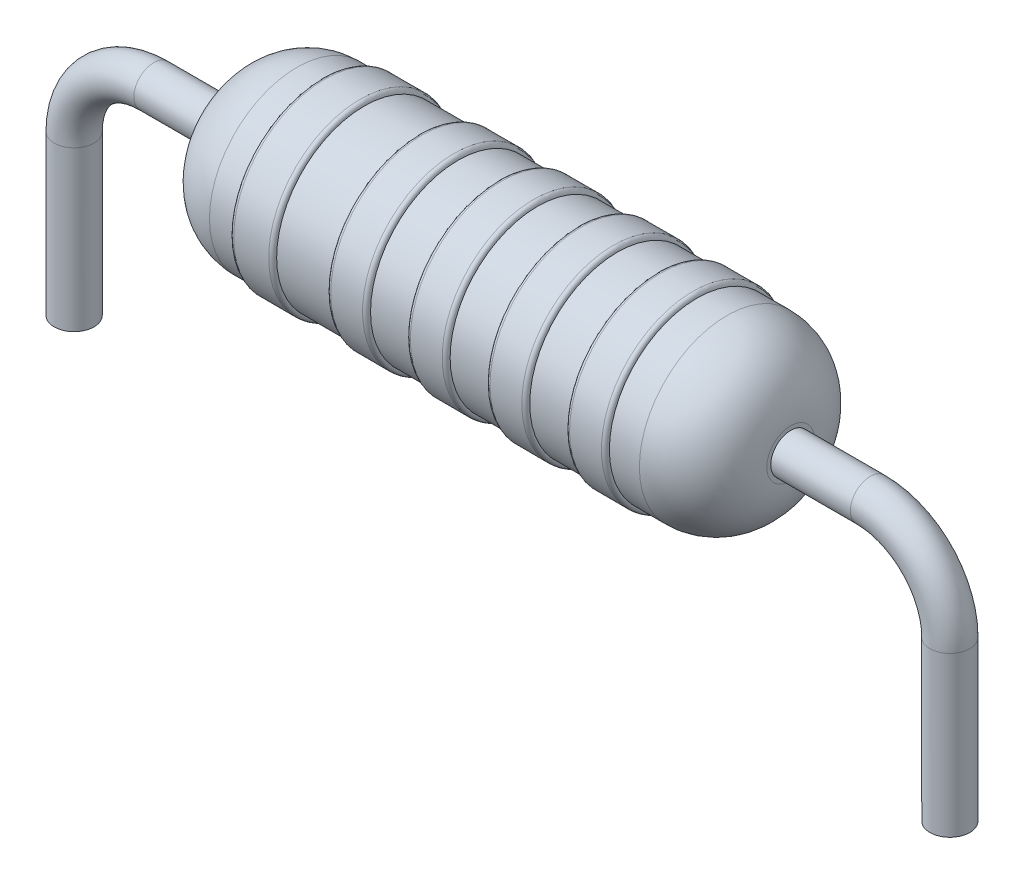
ISO-10303-21;
HEADER;
FILE_DESCRIPTION(('STEP AP214'),'2;1');
FILE_NAME('part.step','',(''),(''),'','','');
FILE_SCHEMA(('AUTOMOTIVE_DESIGN { 1 0 10303 214 1 1 1 1 }'));
ENDSEC;
DATA;
#1=APPLICATION_CONTEXT('core data for automotive mechanical design processes');
#2=APPLICATION_PROTOCOL_DEFINITION('international standard','automotive_design',2000,#1);
#3=PRODUCT_CONTEXT('',#1,'mechanical');
#4=PRODUCT('Part','Part','',(#3));
#5=PRODUCT_RELATED_PRODUCT_CATEGORY('part','',(#4));
#6=PRODUCT_DEFINITION_FORMATION('','',#4);
#7=PRODUCT_DEFINITION_CONTEXT('part definition',#1,'design');
#8=PRODUCT_DEFINITION('design','',#6,#7);
#9=PRODUCT_DEFINITION_SHAPE('','',#8);
#10=(LENGTH_UNIT() NAMED_UNIT(*) SI_UNIT(.MILLI.,.METRE.));
#11=(NAMED_UNIT(*) PLANE_ANGLE_UNIT() SI_UNIT($,.RADIAN.));
#12=(NAMED_UNIT(*) SI_UNIT($,.STERADIAN.) SOLID_ANGLE_UNIT());
#13=UNCERTAINTY_MEASURE_WITH_UNIT(LENGTH_MEASURE(1.E-05),#10,'distance_accuracy_value','');
#14=(GEOMETRIC_REPRESENTATION_CONTEXT(3) GLOBAL_UNCERTAINTY_ASSIGNED_CONTEXT((#13)) GLOBAL_UNIT_ASSIGNED_CONTEXT((#10,
#11,#12)) REPRESENTATION_CONTEXT('',''));
#15=CARTESIAN_POINT('',(0.,0.,0.));
#16=DIRECTION('',(0.,0.,1.));
#17=DIRECTION('',(1.,0.,0.));
#18=AXIS2_PLACEMENT_3D('',#15,#16,#17);
#19=CARTESIAN_POINT('',(-3.5,0.,0.));
#20=DIRECTION('',(1.,0.,0.));
#21=DIRECTION('',(0.,0.,-1.));
#22=AXIS2_PLACEMENT_3D('',#19,#20,#21);
#23=PLANE('',#22);
#24=CARTESIAN_POINT('',(-3.5,0.,0.));
#25=DIRECTION('',(-1.,0.,0.));
#26=DIRECTION('',(0.,0.,1.));
#27=AXIS2_PLACEMENT_3D('',#24,#25,#26);
#28=CIRCLE('',#27,0.299999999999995);
#29=CARTESIAN_POINT('',(-3.5,0.,0.299999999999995));
#30=VERTEX_POINT('',#29);
#31=EDGE_CURVE('E108',#30,#30,#28,.T.);
#32=ORIENTED_EDGE('',*,*,#31,.T.);
#33=EDGE_LOOP('',(#32));
#34=FACE_BOUND('',#33,.T.);
#35=CARTESIAN_POINT('',(-3.5,0.,0.));
#36=DIRECTION('',(1.,0.,0.));
#37=DIRECTION('',(0.,0.,-1.));
#38=AXIS2_PLACEMENT_3D('',#35,#36,#37);
#39=CIRCLE('',#38,0.25);
#40=CARTESIAN_POINT('',(-3.5,0.,-0.25));
#41=VERTEX_POINT('',#40);
#42=EDGE_CURVE('E75',#41,#41,#39,.F.);
#43=ORIENTED_EDGE('',*,*,#42,.F.);
#44=EDGE_LOOP('',(#43));
#45=FACE_BOUND('',#44,.T.);
#46=ADVANCED_FACE('F37',(#34,#45),#23,.F.);
#47=CARTESIAN_POINT('',(-54.2686615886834,0.,0.));
#48=DIRECTION('',(-1.,0.,0.));
#49=DIRECTION('',(0.,0.,1.));
#50=AXIS2_PLACEMENT_3D('',#47,#48,#49);
#51=CYLINDRICAL_SURFACE('',#50,1.1);
#52=CARTESIAN_POINT('',(-1.85616518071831,0.,0.));
#53=DIRECTION('',(1.,0.,0.));
#54=DIRECTION('',(0.,0.,-1.));
#55=AXIS2_PLACEMENT_3D('',#52,#53,#54);
#56=CIRCLE('',#55,1.1);
#57=CARTESIAN_POINT('',(-1.85616518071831,0.,-1.1));
#58=VERTEX_POINT('',#57);
#59=EDGE_CURVE('E87',#58,#58,#56,.T.);
#60=ORIENTED_EDGE('',*,*,#59,.T.);
#61=EDGE_LOOP('',(#60));
#62=FACE_BOUND('',#61,.T.);
#63=CARTESIAN_POINT('',(-1.17702485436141,0.,0.));
#64=DIRECTION('',(-1.,0.,0.));
#65=DIRECTION('',(0.,0.,1.));
#66=AXIS2_PLACEMENT_3D('',#63,#64,#65);
#67=CIRCLE('',#66,1.1);
#68=CARTESIAN_POINT('',(-1.17702485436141,0.,1.1));
#69=VERTEX_POINT('',#68);
#70=EDGE_CURVE('E102',#69,#69,#67,.T.);
#71=ORIENTED_EDGE('',*,*,#70,.T.);
#72=EDGE_LOOP('',(#71));
#73=FACE_BOUND('',#72,.T.);
#74=ADVANCED_FACE('F171',(#62,#73),#51,.T.);
#75=CARTESIAN_POINT('',(-0.177024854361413,0.,0.));
#76=DIRECTION('',(-1.,0.,0.));
#77=DIRECTION('',(0.,0.,1.));
#78=AXIS2_PLACEMENT_3D('',#75,#76,#77);
#79=CIRCLE('',#78,1.1);
#80=CARTESIAN_POINT('',(-0.177024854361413,0.,1.1));
#81=VERTEX_POINT('',#80);
#82=EDGE_CURVE('E96',#81,#81,#79,.T.);
#83=ORIENTED_EDGE('',*,*,#82,.T.);
#84=EDGE_LOOP('',(#83));
#85=FACE_BOUND('',#84,.T.);
#86=CARTESIAN_POINT('',(-0.677024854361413,0.,0.));
#87=DIRECTION('',(1.,0.,0.));
#88=DIRECTION('',(0.,0.,-1.));
#89=AXIS2_PLACEMENT_3D('',#86,#87,#88);
#90=CIRCLE('',#89,1.1);
#91=CARTESIAN_POINT('',(-0.677024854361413,0.,-1.1));
#92=VERTEX_POINT('',#91);
#93=EDGE_CURVE('E105',#92,#92,#90,.T.);
#94=ORIENTED_EDGE('',*,*,#93,.T.);
#95=EDGE_LOOP('',(#94));
#96=FACE_BOUND('',#95,.T.);
#97=ADVANCED_FACE('F177',(#85,#96),#51,.T.);
#98=CARTESIAN_POINT('',(4.3261723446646,0.,0.));
#99=DIRECTION('',(1.,0.,0.));
#100=DIRECTION('',(0.,0.,-1.));
#101=AXIS2_PLACEMENT_3D('',#98,#99,#100);
#102=CYLINDRICAL_SURFACE('',#101,1.15);
#103=CARTESIAN_POINT('',(-1.12702485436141,0.,0.));
#104=DIRECTION('',(-1.,0.,0.));
#105=DIRECTION('',(0.,0.,1.));
#106=AXIS2_PLACEMENT_3D('',#103,#104,#105);
#107=CIRCLE('',#106,1.15);
#108=CARTESIAN_POINT('',(-1.12702485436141,0.,1.15));
#109=VERTEX_POINT('',#108);
#110=EDGE_CURVE('E63',#109,#109,#107,.F.);
#111=ORIENTED_EDGE('',*,*,#110,.T.);
#112=EDGE_LOOP('',(#111));
#113=FACE_BOUND('',#112,.T.);
#114=CARTESIAN_POINT('',(-0.727024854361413,0.,0.));
#115=DIRECTION('',(1.,0.,0.));
#116=DIRECTION('',(0.,0.,-1.));
#117=AXIS2_PLACEMENT_3D('',#114,#115,#116);
#118=CIRCLE('',#117,1.15);
#119=CARTESIAN_POINT('',(-0.727024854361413,0.,-1.15));
#120=VERTEX_POINT('',#119);
#121=EDGE_CURVE('E66',#120,#120,#118,.F.);
#122=ORIENTED_EDGE('',*,*,#121,.T.);
#123=EDGE_LOOP('',(#122));
#124=FACE_BOUND('',#123,.T.);
#125=ADVANCED_FACE('F185',(#113,#124),#102,.T.);
#126=CARTESIAN_POINT('',(4.3261723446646,0.,0.));
#127=DIRECTION('',(1.,0.,0.));
#128=DIRECTION('',(0.,0.,-1.));
#129=AXIS2_PLACEMENT_3D('',#126,#127,#128);
#130=CYLINDRICAL_SURFACE('',#129,1.15);
#131=CARTESIAN_POINT('',(-0.127024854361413,0.,0.));
#132=DIRECTION('',(-1.,0.,0.));
#133=DIRECTION('',(0.,0.,1.));
#134=AXIS2_PLACEMENT_3D('',#131,#132,#133);
#135=CIRCLE('',#134,1.15);
#136=CARTESIAN_POINT('',(-0.127024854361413,0.,1.15));
#137=VERTEX_POINT('',#136);
#138=EDGE_CURVE('E57',#137,#137,#135,.F.);
#139=ORIENTED_EDGE('',*,*,#138,.T.);
#140=EDGE_LOOP('',(#139));
#141=FACE_BOUND('',#140,.T.);
#142=CARTESIAN_POINT('',(0.272975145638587,0.,0.));
#143=DIRECTION('',(1.,0.,0.));
#144=DIRECTION('',(0.,0.,-1.));
#145=AXIS2_PLACEMENT_3D('',#142,#143,#144);
#146=CIRCLE('',#145,1.15);
#147=CARTESIAN_POINT('',(0.272975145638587,0.,-1.15));
#148=VERTEX_POINT('',#147);
#149=EDGE_CURVE('E60',#148,#148,#146,.F.);
#150=ORIENTED_EDGE('',*,*,#149,.T.);
#151=EDGE_LOOP('',(#150));
#152=FACE_BOUND('',#151,.T.);
#153=ADVANCED_FACE('F255',(#141,#152),#130,.T.);
#154=CARTESIAN_POINT('',(0.822975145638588,0.,0.));
#155=DIRECTION('',(-1.,0.,0.));
#156=DIRECTION('',(0.,0.,1.));
#157=AXIS2_PLACEMENT_3D('',#154,#155,#156);
#158=CIRCLE('',#157,1.1);
#159=CARTESIAN_POINT('',(0.822975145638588,0.,1.1));
#160=VERTEX_POINT('',#159);
#161=EDGE_CURVE('E90',#160,#160,#158,.T.);
#162=ORIENTED_EDGE('',*,*,#161,.T.);
#163=EDGE_LOOP('',(#162));
#164=FACE_BOUND('',#163,.T.);
#165=CARTESIAN_POINT('',(0.322975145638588,0.,0.));
#166=DIRECTION('',(1.,0.,0.));
#167=DIRECTION('',(0.,0.,-1.));
#168=AXIS2_PLACEMENT_3D('',#165,#166,#167);
#169=CIRCLE('',#168,1.1);
#170=CARTESIAN_POINT('',(0.322975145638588,0.,-1.1));
#171=VERTEX_POINT('',#170);
#172=EDGE_CURVE('E99',#171,#171,#169,.T.);
#173=ORIENTED_EDGE('',*,*,#172,.T.);
#174=EDGE_LOOP('',(#173));
#175=FACE_BOUND('',#174,.T.);
#176=ADVANCED_FACE('F243',(#164,#175),#51,.T.);
#177=CARTESIAN_POINT('',(4.3261723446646,0.,0.));
#178=DIRECTION('',(1.,0.,0.));
#179=DIRECTION('',(0.,0.,-1.));
#180=AXIS2_PLACEMENT_3D('',#177,#178,#179);
#181=CYLINDRICAL_SURFACE('',#180,1.15);
#182=CARTESIAN_POINT('',(0.872975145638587,0.,0.));
#183=DIRECTION('',(-1.,0.,0.));
#184=DIRECTION('',(0.,0.,1.));
#185=AXIS2_PLACEMENT_3D('',#182,#183,#184);
#186=CIRCLE('',#185,1.15);
#187=CARTESIAN_POINT('',(0.872975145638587,0.,1.15));
#188=VERTEX_POINT('',#187);
#189=EDGE_CURVE('E48',#188,#188,#186,.F.);
#190=ORIENTED_EDGE('',*,*,#189,.T.);
#191=EDGE_LOOP('',(#190));
#192=FACE_BOUND('',#191,.T.);
#193=CARTESIAN_POINT('',(1.27297514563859,0.,0.));
#194=DIRECTION('',(1.,0.,0.));
#195=DIRECTION('',(0.,0.,-1.));
#196=AXIS2_PLACEMENT_3D('',#193,#194,#195);
#197=CIRCLE('',#196,1.15);
#198=CARTESIAN_POINT('',(1.27297514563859,0.,-1.15));
#199=VERTEX_POINT('',#198);
#200=EDGE_CURVE('E52',#199,#199,#197,.F.);
#201=ORIENTED_EDGE('',*,*,#200,.T.);
#202=EDGE_LOOP('',(#201));
#203=FACE_BOUND('',#202,.T.);
#204=ADVANCED_FACE('F242',(#192,#203),#181,.T.);
#205=CARTESIAN_POINT('',(1.82297514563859,0.,0.));
#206=DIRECTION('',(-1.,0.,0.));
#207=DIRECTION('',(0.,0.,1.));
#208=AXIS2_PLACEMENT_3D('',#205,#206,#207);
#209=CIRCLE('',#208,1.1);
#210=CARTESIAN_POINT('',(1.82297514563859,0.,1.1));
#211=VERTEX_POINT('',#210);
#212=EDGE_CURVE('E83',#211,#211,#209,.T.);
#213=ORIENTED_EDGE('',*,*,#212,.T.);
#214=EDGE_LOOP('',(#213));
#215=FACE_BOUND('',#214,.T.);
#216=CARTESIAN_POINT('',(1.32297514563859,0.,0.));
#217=DIRECTION('',(1.,0.,0.));
#218=DIRECTION('',(0.,0.,-1.));
#219=AXIS2_PLACEMENT_3D('',#216,#217,#218);
#220=CIRCLE('',#219,1.1);
#221=CARTESIAN_POINT('',(1.32297514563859,0.,-1.1));
#222=VERTEX_POINT('',#221);
#223=EDGE_CURVE('E93',#222,#222,#220,.T.);
#224=ORIENTED_EDGE('',*,*,#223,.T.);
#225=EDGE_LOOP('',(#224));
#226=FACE_BOUND('',#225,.T.);
#227=ADVANCED_FACE('F180',(#215,#226),#51,.T.);
#228=CARTESIAN_POINT('',(4.3261723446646,0.,0.));
#229=DIRECTION('',(1.,0.,0.));
#230=DIRECTION('',(0.,0.,-1.));
#231=AXIS2_PLACEMENT_3D('',#228,#229,#230);
#232=CYLINDRICAL_SURFACE('',#231,1.15);
#233=CARTESIAN_POINT('',(-2.34563407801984,0.,0.));
#234=DIRECTION('',(-1.,0.,0.));
#235=DIRECTION('',(0.,0.,1.));
#236=AXIS2_PLACEMENT_3D('',#233,#234,#235);
#237=CIRCLE('',#236,1.15);
#238=CARTESIAN_POINT('',(-2.34563407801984,0.,1.15));
#239=VERTEX_POINT('',#238);
#240=EDGE_CURVE('E69',#239,#239,#237,.F.);
#241=ORIENTED_EDGE('',*,*,#240,.T.);
#242=EDGE_LOOP('',(#241));
#243=FACE_BOUND('',#242,.T.);
#244=CARTESIAN_POINT('',(-1.90616518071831,0.,0.));
#245=DIRECTION('',(1.,0.,0.));
#246=DIRECTION('',(0.,0.,-1.));
#247=AXIS2_PLACEMENT_3D('',#244,#245,#246);
#248=CIRCLE('',#247,1.15);
#249=CARTESIAN_POINT('',(-1.90616518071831,0.,-1.15));
#250=VERTEX_POINT('',#249);
#251=EDGE_CURVE('E72',#250,#250,#248,.F.);
#252=ORIENTED_EDGE('',*,*,#251,.T.);
#253=EDGE_LOOP('',(#252));
#254=FACE_BOUND('',#253,.T.);
#255=ADVANCED_FACE('F190',(#243,#254),#232,.T.);
#256=CARTESIAN_POINT('',(-2.7,0.,0.));
#257=DIRECTION('',(-1.,0.,0.));
#258=DIRECTION('',(0.,0.,1.));
#259=AXIS2_PLACEMENT_3D('',#256,#257,#258);
#260=DEGENERATE_TOROIDAL_SURFACE('',#259,0.3,0.8,.T.);
#261=ORIENTED_EDGE('',*,*,#31,.F.);
#262=EDGE_LOOP('',(#261));
#263=FACE_BOUND('',#262,.T.);
#264=CARTESIAN_POINT('',(-2.69999999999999,0.,0.));
#265=DIRECTION('',(-1.,0.,0.));
#266=DIRECTION('',(0.,0.,1.));
#267=AXIS2_PLACEMENT_3D('',#264,#265,#266);
#268=CIRCLE('',#267,1.1);
#269=CARTESIAN_POINT('',(-2.69999999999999,0.,1.1));
#270=VERTEX_POINT('',#269);
#271=EDGE_CURVE('E116',#270,#270,#268,.T.);
#272=ORIENTED_EDGE('',*,*,#271,.T.);
#273=EDGE_LOOP('',(#272));
#274=FACE_BOUND('',#273,.T.);
#275=ADVANCED_FACE('F187',(#263,#274),#260,.T.);
#276=CARTESIAN_POINT('',(-2.39563407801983,0.,0.));
#277=DIRECTION('',(-1.,0.,0.));
#278=DIRECTION('',(0.,0.,1.));
#279=AXIS2_PLACEMENT_3D('',#276,#277,#278);
#280=CIRCLE('',#279,1.1);
#281=CARTESIAN_POINT('',(-2.39563407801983,0.,1.1));
#282=VERTEX_POINT('',#281);
#283=EDGE_CURVE('E82',#282,#282,#280,.T.);
#284=ORIENTED_EDGE('',*,*,#283,.T.);
#285=EDGE_LOOP('',(#284));
#286=FACE_BOUND('',#285,.T.);
#287=ORIENTED_EDGE('',*,*,#271,.F.);
#288=EDGE_LOOP('',(#287));
#289=FACE_BOUND('',#288,.T.);
#290=ADVANCED_FACE('F189',(#286,#289),#51,.T.);
#291=CARTESIAN_POINT('',(4.3261723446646,0.,0.));
#292=DIRECTION('',(1.,0.,0.));
#293=DIRECTION('',(0.,0.,-1.));
#294=AXIS2_PLACEMENT_3D('',#291,#292,#293);
#295=CYLINDRICAL_SURFACE('',#294,1.15);
#296=CARTESIAN_POINT('',(1.87297514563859,0.,0.));
#297=DIRECTION('',(-1.,0.,0.));
#298=DIRECTION('',(0.,0.,1.));
#299=AXIS2_PLACEMENT_3D('',#296,#297,#298);
#300=CIRCLE('',#299,1.15);
#301=CARTESIAN_POINT('',(1.87297514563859,0.,1.15));
#302=VERTEX_POINT('',#301);
#303=EDGE_CURVE('E10',#302,#302,#300,.F.);
#304=ORIENTED_EDGE('',*,*,#303,.T.);
#305=EDGE_LOOP('',(#304));
#306=FACE_BOUND('',#305,.T.);
#307=CARTESIAN_POINT('',(2.27297514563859,0.,0.));
#308=DIRECTION('',(1.,0.,0.));
#309=DIRECTION('',(0.,0.,-1.));
#310=AXIS2_PLACEMENT_3D('',#307,#308,#309);
#311=CIRCLE('',#310,1.15);
#312=CARTESIAN_POINT('',(2.27297514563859,0.,-1.15));
#313=VERTEX_POINT('',#312);
#314=EDGE_CURVE('E44',#313,#313,#311,.F.);
#315=ORIENTED_EDGE('',*,*,#314,.T.);
#316=EDGE_LOOP('',(#315));
#317=FACE_BOUND('',#316,.T.);
#318=ADVANCED_FACE('F194',(#306,#317),#295,.T.);
#319=CARTESIAN_POINT('',(3.5,0.299999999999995,0.));
#320=DIRECTION('',(-1.,0.,0.));
#321=DIRECTION('',(0.,0.,1.));
#322=AXIS2_PLACEMENT_3D('',#319,#320,#321);
#323=PLANE('',#322);
#324=CARTESIAN_POINT('',(3.5,0.,0.));
#325=DIRECTION('',(-1.,0.,0.));
#326=DIRECTION('',(0.,0.,1.));
#327=AXIS2_PLACEMENT_3D('',#324,#325,#326);
#328=CIRCLE('',#327,0.25);
#329=CARTESIAN_POINT('',(3.5,0.,0.25));
#330=VERTEX_POINT('',#329);
#331=EDGE_CURVE('E136',#330,#330,#328,.T.);
#332=ORIENTED_EDGE('',*,*,#331,.T.);
#333=EDGE_LOOP('',(#332));
#334=FACE_BOUND('',#333,.T.);
#335=CARTESIAN_POINT('',(3.5,0.,0.));
#336=DIRECTION('',(-1.,0.,0.));
#337=DIRECTION('',(0.,0.,1.));
#338=AXIS2_PLACEMENT_3D('',#335,#336,#337);
#339=CIRCLE('',#338,0.299999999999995);
#340=CARTESIAN_POINT('',(3.5,0.,0.299999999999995));
#341=VERTEX_POINT('',#340);
#342=EDGE_CURVE('E78',#341,#341,#339,.T.);
#343=ORIENTED_EDGE('',*,*,#342,.F.);
#344=EDGE_LOOP('',(#343));
#345=FACE_BOUND('',#344,.T.);
#346=ADVANCED_FACE('F199',(#334,#345),#323,.F.);
#347=CARTESIAN_POINT('',(2.7,0.,0.));
#348=DIRECTION('',(-1.,0.,0.));
#349=DIRECTION('',(0.,0.,1.));
#350=AXIS2_PLACEMENT_3D('',#347,#348,#349);
#351=DEGENERATE_TOROIDAL_SURFACE('',#350,0.3,0.8,.T.);
#352=CARTESIAN_POINT('',(2.69999999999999,0.,0.));
#353=DIRECTION('',(-1.,0.,0.));
#354=DIRECTION('',(0.,0.,1.));
#355=AXIS2_PLACEMENT_3D('',#352,#353,#354);
#356=CIRCLE('',#355,1.1);
#357=CARTESIAN_POINT('',(2.69999999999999,0.,1.1));
#358=VERTEX_POINT('',#357);
#359=EDGE_CURVE('E113',#358,#358,#356,.T.);
#360=ORIENTED_EDGE('',*,*,#359,.F.);
#361=EDGE_LOOP('',(#360));
#362=FACE_BOUND('',#361,.T.);
#363=ORIENTED_EDGE('',*,*,#342,.T.);
#364=EDGE_LOOP('',(#363));
#365=FACE_BOUND('',#364,.T.);
#366=ADVANCED_FACE('F196',(#362,#365),#351,.T.);
#367=CARTESIAN_POINT('',(2.32297514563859,0.,0.));
#368=DIRECTION('',(1.,0.,0.));
#369=DIRECTION('',(0.,0.,-1.));
#370=AXIS2_PLACEMENT_3D('',#367,#368,#369);
#371=CIRCLE('',#370,1.1);
#372=CARTESIAN_POINT('',(2.32297514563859,0.,-1.1));
#373=VERTEX_POINT('',#372);
#374=EDGE_CURVE('E79',#373,#373,#371,.T.);
#375=ORIENTED_EDGE('',*,*,#374,.T.);
#376=EDGE_LOOP('',(#375));
#377=FACE_BOUND('',#376,.T.);
#378=ORIENTED_EDGE('',*,*,#359,.T.);
#379=EDGE_LOOP('',(#378));
#380=FACE_BOUND('',#379,.T.);
#381=ADVANCED_FACE('F181',(#377,#380),#51,.T.);
#382=CARTESIAN_POINT('',(-5.5,-1.00000000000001,0.));
#383=DIRECTION('',(0.,-1.,0.));
#384=DIRECTION('',(0.,0.,-1.));
#385=AXIS2_PLACEMENT_3D('',#382,#383,#384);
#386=CYLINDRICAL_SURFACE('',#385,0.25);
#387=CARTESIAN_POINT('',(-5.5,-1.00000000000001,0.));
#388=DIRECTION('',(0.,-1.,0.));
#389=DIRECTION('',(0.,0.,1.));
#390=AXIS2_PLACEMENT_3D('',#387,#388,#389);
#391=CIRCLE('',#390,0.25);
#392=CARTESIAN_POINT('',(-5.75,-1.00000000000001,0.));
#393=VERTEX_POINT('',#392);
#394=EDGE_CURVE('E123',#393,#393,#391,.T.);
#395=ORIENTED_EDGE('',*,*,#394,.T.);
#396=EDGE_LOOP('',(#395));
#397=FACE_BOUND('',#396,.T.);
#398=CARTESIAN_POINT('',(-5.5,-3.,0.));
#399=DIRECTION('',(0.,-1.,0.));
#400=DIRECTION('',(0.,0.,1.));
#401=AXIS2_PLACEMENT_3D('',#398,#399,#400);
#402=CIRCLE('',#401,0.25);
#403=CARTESIAN_POINT('',(-5.5,-3.,0.25));
#404=VERTEX_POINT('',#403);
#405=EDGE_CURVE('E86',#404,#404,#402,.T.);
#406=ORIENTED_EDGE('',*,*,#405,.F.);
#407=EDGE_LOOP('',(#406));
#408=FACE_BOUND('',#407,.T.);
#409=ADVANCED_FACE('F400',(#397,#408),#386,.T.);
#410=CARTESIAN_POINT('',(-4.5,-1.,0.));
#411=DIRECTION('',(0.,0.,1.));
#412=DIRECTION('',(1.,0.,0.));
#413=AXIS2_PLACEMENT_3D('',#410,#411,#412);
#414=TOROIDAL_SURFACE('',#413,1.,0.25);
#415=CARTESIAN_POINT('',(-4.49999999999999,0.,0.));
#416=DIRECTION('',(-1.,0.,0.));
#417=DIRECTION('',(0.,0.,1.));
#418=AXIS2_PLACEMENT_3D('',#415,#416,#417);
#419=CIRCLE('',#418,0.25);
#420=CARTESIAN_POINT('',(-4.49999999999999,0.25,0.));
#421=VERTEX_POINT('',#420);
#422=EDGE_CURVE('E126',#421,#421,#419,.T.);
#423=CARTESIAN_POINT('',(-4.5,-1.,0.));
#424=DIRECTION('',(0.,0.,1.));
#425=DIRECTION('',(1.,0.,0.));
#426=AXIS2_PLACEMENT_3D('',#423,#424,#425);
#427=CIRCLE('',#426,1.25);
#428=EDGE_CURVE('',#421,#393,#427,.T.);
#429=ORIENTED_EDGE('',*,*,#422,.T.);
#430=ORIENTED_EDGE('',*,*,#394,.F.);
#431=ORIENTED_EDGE('',*,*,#428,.T.);
#432=ORIENTED_EDGE('',*,*,#428,.F.);
#433=EDGE_LOOP('',(#429,#431,#430,#432));
#434=FACE_BOUND('',#433,.T.);
#435=ADVANCED_FACE('F415',(#434),#414,.T.);
#436=CARTESIAN_POINT('',(-4.49999999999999,0.,0.));
#437=DIRECTION('',(1.,0.,0.));
#438=DIRECTION('',(0.,0.,-1.));
#439=AXIS2_PLACEMENT_3D('',#436,#437,#438);
#440=CYLINDRICAL_SURFACE('',#439,0.25);
#441=ORIENTED_EDGE('',*,*,#422,.F.);
#442=EDGE_LOOP('',(#441));
#443=FACE_BOUND('',#442,.T.);
#444=ORIENTED_EDGE('',*,*,#42,.T.);
#445=EDGE_LOOP('',(#444));
#446=FACE_BOUND('',#445,.T.);
#447=ADVANCED_FACE('F425',(#443,#446),#440,.T.);
#448=CARTESIAN_POINT('',(-5.5,-3.,0.));
#449=DIRECTION('',(0.,-1.,0.));
#450=DIRECTION('',(0.,0.,1.));
#451=AXIS2_PLACEMENT_3D('',#448,#449,#450);
#452=PLANE('',#451);
#453=ORIENTED_EDGE('',*,*,#405,.T.);
#454=EDGE_LOOP('',(#453));
#455=FACE_BOUND('',#454,.T.);
#456=ADVANCED_FACE('F154',(#455),#452,.T.);
#457=CARTESIAN_POINT('',(5.5,-1.00000000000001,0.));
#458=DIRECTION('',(0.,-1.,0.));
#459=DIRECTION('',(0.,0.,-1.));
#460=AXIS2_PLACEMENT_3D('',#457,#458,#459);
#461=CYLINDRICAL_SURFACE('',#460,0.25);
#462=CARTESIAN_POINT('',(5.5,-1.00000000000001,0.));
#463=DIRECTION('',(0.,1.,0.));
#464=DIRECTION('',(0.,0.,1.));
#465=AXIS2_PLACEMENT_3D('',#462,#463,#464);
#466=CIRCLE('',#465,0.25);
#467=CARTESIAN_POINT('',(5.75,-1.00000000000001,0.));
#468=VERTEX_POINT('',#467);
#469=EDGE_CURVE('E132',#468,#468,#466,.T.);
#470=ORIENTED_EDGE('',*,*,#469,.F.);
#471=EDGE_LOOP('',(#470));
#472=FACE_BOUND('',#471,.T.);
#473=CARTESIAN_POINT('',(5.5,-3.,0.));
#474=DIRECTION('',(0.,1.,0.));
#475=DIRECTION('',(0.,0.,1.));
#476=AXIS2_PLACEMENT_3D('',#473,#474,#475);
#477=CIRCLE('',#476,0.25);
#478=CARTESIAN_POINT('',(5.5,-3.,0.25));
#479=VERTEX_POINT('',#478);
#480=EDGE_CURVE('E129',#479,#479,#477,.T.);
#481=ORIENTED_EDGE('',*,*,#480,.T.);
#482=EDGE_LOOP('',(#481));
#483=FACE_BOUND('',#482,.T.);
#484=ADVANCED_FACE('F148',(#472,#483),#461,.T.);
#485=CARTESIAN_POINT('',(4.5,-1.,0.));
#486=DIRECTION('',(0.,0.,-1.));
#487=DIRECTION('',(-1.,0.,0.));
#488=AXIS2_PLACEMENT_3D('',#485,#486,#487);
#489=TOROIDAL_SURFACE('',#488,1.,0.25);
#490=CARTESIAN_POINT('',(4.49999999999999,0.,0.));
#491=DIRECTION('',(-1.,0.,0.));
#492=DIRECTION('',(0.,0.,1.));
#493=AXIS2_PLACEMENT_3D('',#490,#491,#492);
#494=CIRCLE('',#493,0.25);
#495=CARTESIAN_POINT('',(4.49999999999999,0.25,0.));
#496=VERTEX_POINT('',#495);
#497=EDGE_CURVE('E135',#496,#496,#494,.T.);
#498=CARTESIAN_POINT('',(4.5,-1.,0.));
#499=DIRECTION('',(0.,0.,-1.));
#500=DIRECTION('',(-1.,0.,0.));
#501=AXIS2_PLACEMENT_3D('',#498,#499,#500);
#502=CIRCLE('',#501,1.25);
#503=EDGE_CURVE('',#496,#468,#502,.T.);
#504=ORIENTED_EDGE('',*,*,#497,.F.);
#505=ORIENTED_EDGE('',*,*,#469,.T.);
#506=ORIENTED_EDGE('',*,*,#503,.T.);
#507=ORIENTED_EDGE('',*,*,#503,.F.);
#508=EDGE_LOOP('',(#504,#506,#505,#507));
#509=FACE_BOUND('',#508,.T.);
#510=ADVANCED_FACE('F145',(#509),#489,.T.);
#511=CARTESIAN_POINT('',(4.49999999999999,0.,0.));
#512=DIRECTION('',(-1.,0.,0.));
#513=DIRECTION('',(0.,0.,1.));
#514=AXIS2_PLACEMENT_3D('',#511,#512,#513);
#515=CYLINDRICAL_SURFACE('',#514,0.25);
#516=ORIENTED_EDGE('',*,*,#497,.T.);
#517=EDGE_LOOP('',(#516));
#518=FACE_BOUND('',#517,.T.);
#519=ORIENTED_EDGE('',*,*,#331,.F.);
#520=EDGE_LOOP('',(#519));
#521=FACE_BOUND('',#520,.T.);
#522=ADVANCED_FACE('F142',(#518,#521),#515,.T.);
#523=CARTESIAN_POINT('',(5.5,-3.,0.));
#524=DIRECTION('',(0.,-1.,0.));
#525=DIRECTION('',(0.,0.,1.));
#526=AXIS2_PLACEMENT_3D('',#523,#524,#525);
#527=PLANE('',#526);
#528=ORIENTED_EDGE('',*,*,#480,.F.);
#529=EDGE_LOOP('',(#528));
#530=FACE_BOUND('',#529,.T.);
#531=ADVANCED_FACE('F158',(#530),#527,.T.);
#532=CARTESIAN_POINT('',(-2.34563407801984,0.,0.));
#533=DIRECTION('',(-1.,0.,0.));
#534=DIRECTION('',(0.,0.,1.));
#535=AXIS2_PLACEMENT_3D('',#532,#533,#534);
#536=TOROIDAL_SURFACE('',#535,1.1,0.05);
#537=ORIENTED_EDGE('',*,*,#283,.F.);
#538=EDGE_LOOP('',(#537));
#539=FACE_BOUND('',#538,.T.);
#540=ORIENTED_EDGE('',*,*,#240,.F.);
#541=EDGE_LOOP('',(#540));
#542=FACE_BOUND('',#541,.T.);
#543=ADVANCED_FACE('F160',(#539,#542),#536,.T.);
#544=CARTESIAN_POINT('',(-1.90616518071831,0.,0.));
#545=DIRECTION('',(1.,0.,0.));
#546=DIRECTION('',(0.,0.,-1.));
#547=AXIS2_PLACEMENT_3D('',#544,#545,#546);
#548=TOROIDAL_SURFACE('',#547,1.1,0.05);
#549=ORIENTED_EDGE('',*,*,#251,.F.);
#550=EDGE_LOOP('',(#549));
#551=FACE_BOUND('',#550,.T.);
#552=ORIENTED_EDGE('',*,*,#59,.F.);
#553=EDGE_LOOP('',(#552));
#554=FACE_BOUND('',#553,.T.);
#555=ADVANCED_FACE('F166',(#551,#554),#548,.T.);
#556=CARTESIAN_POINT('',(-1.12702485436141,0.,0.));
#557=DIRECTION('',(-1.,0.,0.));
#558=DIRECTION('',(0.,0.,1.));
#559=AXIS2_PLACEMENT_3D('',#556,#557,#558);
#560=TOROIDAL_SURFACE('',#559,1.1,0.05);
#561=ORIENTED_EDGE('',*,*,#70,.F.);
#562=EDGE_LOOP('',(#561));
#563=FACE_BOUND('',#562,.T.);
#564=ORIENTED_EDGE('',*,*,#110,.F.);
#565=EDGE_LOOP('',(#564));
#566=FACE_BOUND('',#565,.T.);
#567=ADVANCED_FACE('F206',(#563,#566),#560,.T.);
#568=CARTESIAN_POINT('',(-0.727024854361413,0.,0.));
#569=DIRECTION('',(1.,0.,0.));
#570=DIRECTION('',(0.,0.,-1.));
#571=AXIS2_PLACEMENT_3D('',#568,#569,#570);
#572=TOROIDAL_SURFACE('',#571,1.1,0.05);
#573=ORIENTED_EDGE('',*,*,#121,.F.);
#574=EDGE_LOOP('',(#573));
#575=FACE_BOUND('',#574,.T.);
#576=ORIENTED_EDGE('',*,*,#93,.F.);
#577=EDGE_LOOP('',(#576));
#578=FACE_BOUND('',#577,.T.);
#579=ADVANCED_FACE('F210',(#575,#578),#572,.T.);
#580=CARTESIAN_POINT('',(-0.127024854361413,0.,0.));
#581=DIRECTION('',(-1.,0.,0.));
#582=DIRECTION('',(0.,0.,1.));
#583=AXIS2_PLACEMENT_3D('',#580,#581,#582);
#584=TOROIDAL_SURFACE('',#583,1.1,0.05);
#585=ORIENTED_EDGE('',*,*,#82,.F.);
#586=EDGE_LOOP('',(#585));
#587=FACE_BOUND('',#586,.T.);
#588=ORIENTED_EDGE('',*,*,#138,.F.);
#589=EDGE_LOOP('',(#588));
#590=FACE_BOUND('',#589,.T.);
#591=ADVANCED_FACE('F214',(#587,#590),#584,.T.);
#592=CARTESIAN_POINT('',(0.272975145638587,0.,0.));
#593=DIRECTION('',(1.,0.,0.));
#594=DIRECTION('',(0.,0.,-1.));
#595=AXIS2_PLACEMENT_3D('',#592,#593,#594);
#596=TOROIDAL_SURFACE('',#595,1.1,0.05);
#597=ORIENTED_EDGE('',*,*,#149,.F.);
#598=EDGE_LOOP('',(#597));
#599=FACE_BOUND('',#598,.T.);
#600=ORIENTED_EDGE('',*,*,#172,.F.);
#601=EDGE_LOOP('',(#600));
#602=FACE_BOUND('',#601,.T.);
#603=ADVANCED_FACE('F218',(#599,#602),#596,.T.);
#604=CARTESIAN_POINT('',(0.872975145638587,0.,0.));
#605=DIRECTION('',(-1.,0.,0.));
#606=DIRECTION('',(0.,0.,1.));
#607=AXIS2_PLACEMENT_3D('',#604,#605,#606);
#608=TOROIDAL_SURFACE('',#607,1.1,0.05);
#609=ORIENTED_EDGE('',*,*,#161,.F.);
#610=EDGE_LOOP('',(#609));
#611=FACE_BOUND('',#610,.T.);
#612=ORIENTED_EDGE('',*,*,#189,.F.);
#613=EDGE_LOOP('',(#612));
#614=FACE_BOUND('',#613,.T.);
#615=ADVANCED_FACE('F222',(#611,#614),#608,.T.);
#616=CARTESIAN_POINT('',(1.27297514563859,0.,0.));
#617=DIRECTION('',(1.,0.,0.));
#618=DIRECTION('',(0.,0.,-1.));
#619=AXIS2_PLACEMENT_3D('',#616,#617,#618);
#620=TOROIDAL_SURFACE('',#619,1.1,0.05);
#621=ORIENTED_EDGE('',*,*,#200,.F.);
#622=EDGE_LOOP('',(#621));
#623=FACE_BOUND('',#622,.T.);
#624=ORIENTED_EDGE('',*,*,#223,.F.);
#625=EDGE_LOOP('',(#624));
#626=FACE_BOUND('',#625,.T.);
#627=ADVANCED_FACE('F226',(#623,#626),#620,.T.);
#628=CARTESIAN_POINT('',(1.87297514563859,0.,0.));
#629=DIRECTION('',(-1.,0.,0.));
#630=DIRECTION('',(0.,0.,1.));
#631=AXIS2_PLACEMENT_3D('',#628,#629,#630);
#632=TOROIDAL_SURFACE('',#631,1.1,0.05);
#633=ORIENTED_EDGE('',*,*,#212,.F.);
#634=EDGE_LOOP('',(#633));
#635=FACE_BOUND('',#634,.T.);
#636=ORIENTED_EDGE('',*,*,#303,.F.);
#637=EDGE_LOOP('',(#636));
#638=FACE_BOUND('',#637,.T.);
#639=ADVANCED_FACE('F229',(#635,#638),#632,.T.);
#640=CARTESIAN_POINT('',(2.27297514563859,0.,0.));
#641=DIRECTION('',(1.,0.,0.));
#642=DIRECTION('',(0.,0.,-1.));
#643=AXIS2_PLACEMENT_3D('',#640,#641,#642);
#644=TOROIDAL_SURFACE('',#643,1.1,0.05);
#645=ORIENTED_EDGE('',*,*,#314,.F.);
#646=EDGE_LOOP('',(#645));
#647=FACE_BOUND('',#646,.T.);
#648=ORIENTED_EDGE('',*,*,#374,.F.);
#649=EDGE_LOOP('',(#648));
#650=FACE_BOUND('',#649,.T.);
#651=ADVANCED_FACE('F39',(#647,#650),#644,.T.);
#652=CLOSED_SHELL('',(#46,#74,#97,#125,#153,#176,#204,#227,#255,#275,#290,#318,#346,#366,#381,
#409,#435,#447,#456,#484,#510,#522,#531,#543,#555,#567,#579,#591,#603,#615,#627,#639,#651));
#653=MANIFOLD_SOLID_BREP('B2',#652);
#654=ADVANCED_BREP_SHAPE_REPRESENTATION('',(#18,#653),#14);
#655=SHAPE_DEFINITION_REPRESENTATION(#9,#654);
ENDSEC;
END-ISO-10303-21;
